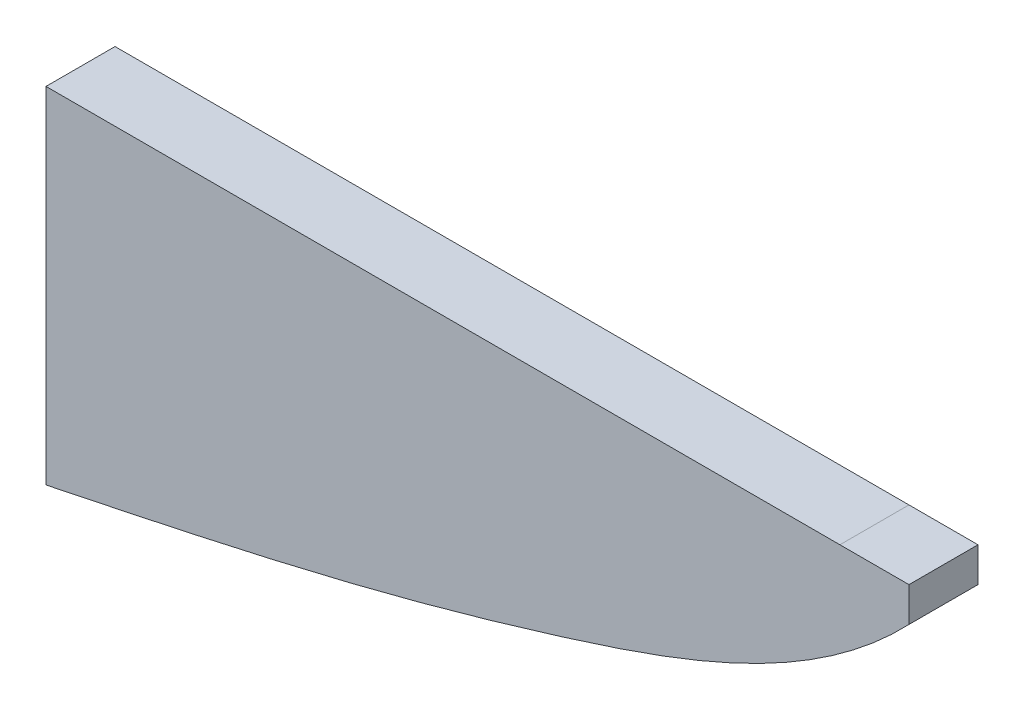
from build123d import *

# Parameters (mm, degrees)
AUFSATZ_LINEAR_AUSTRAGEN1_DEPTH = 20


with BuildPart() as part:
    # Skizze1 → Aufsatz-Linear austragen1 (new body)
    with BuildSketch(Plane.XY):
        with BuildLine():
            Line((0, -50), (0, 50))
            Line((0, 50), (250, 50))
            Line((250, 50), (250, 40))
            add(Edge.make_bspline(
                [(0, -50), (33.41994869, -43.060858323), (83.963255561, -32.55419778), (169.944017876, -7.883209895), (222.615387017, 11.374413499), (250, 40)],
                knots=[0, 0, 0, 0, 0.381514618, 0.575066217, 1, 1, 1, 1], degree=3))
        make_face()
    extrude(amount=AUFSATZ_LINEAR_AUSTRAGEN1_DEPTH)


solid = part.part
